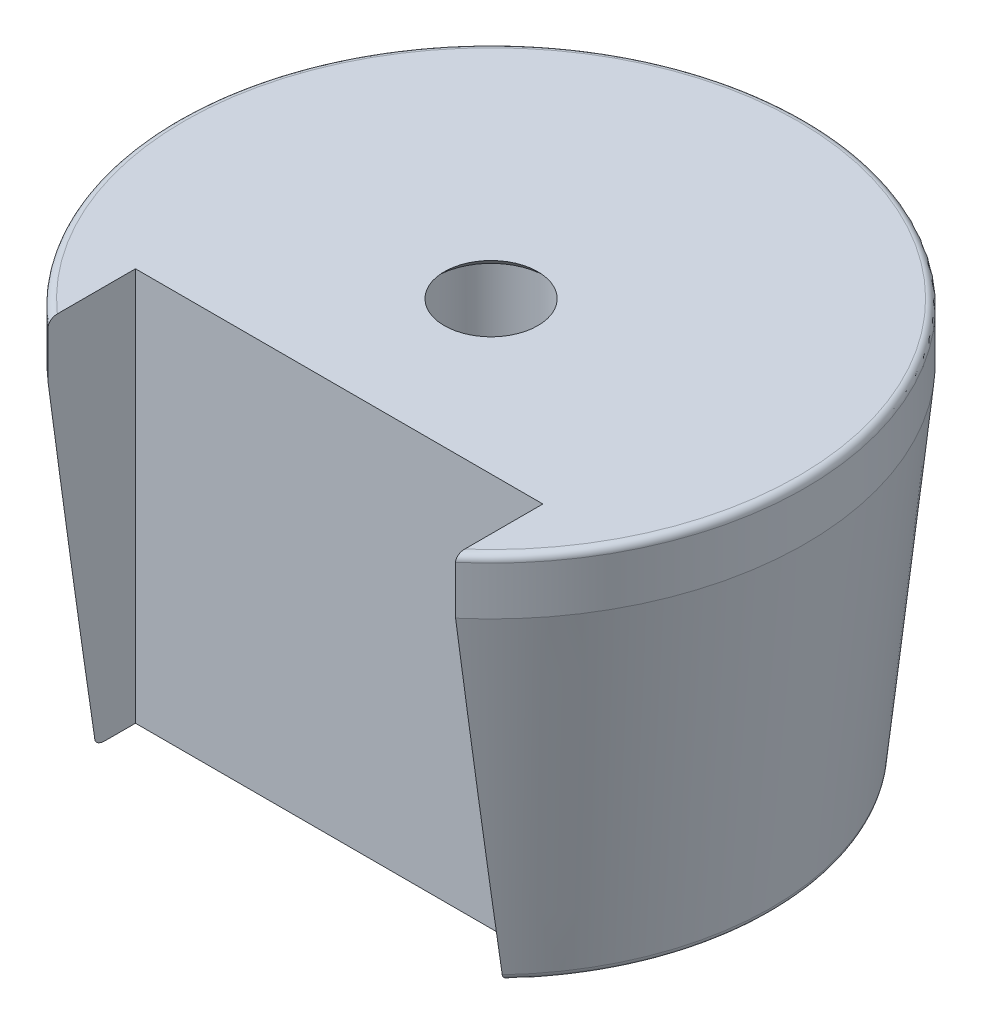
ISO-10303-21;
HEADER;
FILE_DESCRIPTION(('STEP AP214'),'2;1');
FILE_NAME('part.step','',(''),(''),'','','');
FILE_SCHEMA(('AUTOMOTIVE_DESIGN { 1 0 10303 214 1 1 1 1 }'));
ENDSEC;
DATA;
#1=APPLICATION_CONTEXT('core data for automotive mechanical design processes');
#2=APPLICATION_PROTOCOL_DEFINITION('international standard','automotive_design',2000,#1);
#3=PRODUCT_CONTEXT('',#1,'mechanical');
#4=PRODUCT('Part','Part','',(#3));
#5=PRODUCT_RELATED_PRODUCT_CATEGORY('part','',(#4));
#6=PRODUCT_DEFINITION_FORMATION('','',#4);
#7=PRODUCT_DEFINITION_CONTEXT('part definition',#1,'design');
#8=PRODUCT_DEFINITION('design','',#6,#7);
#9=PRODUCT_DEFINITION_SHAPE('','',#8);
#10=(LENGTH_UNIT() NAMED_UNIT(*) SI_UNIT(.MILLI.,.METRE.));
#11=(NAMED_UNIT(*) PLANE_ANGLE_UNIT() SI_UNIT($,.RADIAN.));
#12=(NAMED_UNIT(*) SI_UNIT($,.STERADIAN.) SOLID_ANGLE_UNIT());
#13=UNCERTAINTY_MEASURE_WITH_UNIT(LENGTH_MEASURE(1.E-05),#10,'distance_accuracy_value','');
#14=(GEOMETRIC_REPRESENTATION_CONTEXT(3) GLOBAL_UNCERTAINTY_ASSIGNED_CONTEXT((#13)) GLOBAL_UNIT_ASSIGNED_CONTEXT((#10,
#11,#12)) REPRESENTATION_CONTEXT('',''));
#15=CARTESIAN_POINT('',(0.,0.,0.));
#16=DIRECTION('',(0.,0.,1.));
#17=DIRECTION('',(1.,0.,0.));
#18=AXIS2_PLACEMENT_3D('',#15,#16,#17);
#19=CARTESIAN_POINT('',(0.,0.,-69.));
#20=DIRECTION('',(0.,1.,0.));
#21=DIRECTION('',(0.,0.,1.));
#22=AXIS2_PLACEMENT_3D('',#19,#20,#21);
#23=PLANE('',#22);
#24=CARTESIAN_POINT('',(0.,0.,-69.));
#25=DIRECTION('',(0.,-1.,0.));
#26=DIRECTION('',(0.,0.,-1.));
#27=AXIS2_PLACEMENT_3D('',#24,#25,#26);
#28=CIRCLE('',#27,8.);
#29=CARTESIAN_POINT('',(0.,0.,-77.));
#30=VERTEX_POINT('',#29);
#31=EDGE_CURVE('E19',#30,#30,#28,.F.);
#32=ORIENTED_EDGE('',*,*,#31,.T.);
#33=EDGE_LOOP('',(#32));
#34=FACE_BOUND('',#33,.T.);
#35=ADVANCED_FACE('F16',(#34),#23,.T.);
#36=CARTESIAN_POINT('',(0.,132.,-69.));
#37=DIRECTION('',(0.,-1.,0.));
#38=DIRECTION('',(0.,0.,-1.));
#39=AXIS2_PLACEMENT_3D('',#36,#37,#38);
#40=CYLINDRICAL_SURFACE('',#39,8.);
#41=ORIENTED_EDGE('',*,*,#31,.F.);
#42=EDGE_LOOP('',(#41));
#43=FACE_BOUND('',#42,.T.);
#44=CARTESIAN_POINT('',(0.,25.773,-69.));
#45=DIRECTION('',(0.,-1.,0.));
#46=DIRECTION('',(0.,0.,-1.));
#47=AXIS2_PLACEMENT_3D('',#44,#45,#46);
#48=CIRCLE('',#47,8.);
#49=CARTESIAN_POINT('',(0.,25.773,-77.));
#50=VERTEX_POINT('',#49);
#51=EDGE_CURVE('E135',#50,#50,#48,.F.);
#52=ORIENTED_EDGE('',*,*,#51,.T.);
#53=EDGE_LOOP('',(#52));
#54=FACE_BOUND('',#53,.T.);
#55=ADVANCED_FACE('F171',(#43,#54),#40,.F.);
#56=CARTESIAN_POINT('',(0.,25.773,-69.));
#57=DIRECTION('',(0.,-1.,0.));
#58=DIRECTION('',(1.,0.,0.));
#59=AXIS2_PLACEMENT_3D('',#56,#57,#58);
#60=CONICAL_SURFACE('',#59,8.,0.785398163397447);
#61=ORIENTED_EDGE('',*,*,#51,.F.);
#62=EDGE_LOOP('',(#61));
#63=FACE_BOUND('',#62,.T.);
#64=CARTESIAN_POINT('',(0.,27.,-69.));
#65=DIRECTION('',(0.,-1.,0.));
#66=DIRECTION('',(1.,0.,0.));
#67=AXIS2_PLACEMENT_3D('',#64,#65,#66);
#68=CIRCLE('',#67,6.773);
#69=CARTESIAN_POINT('',(6.773,27.,-69.));
#70=VERTEX_POINT('',#69);
#71=EDGE_CURVE('E125',#70,#70,#68,.F.);
#72=ORIENTED_EDGE('',*,*,#71,.T.);
#73=EDGE_LOOP('',(#72));
#74=FACE_BOUND('',#73,.T.);
#75=ADVANCED_FACE('F169',(#63,#74),#60,.F.);
#76=CARTESIAN_POINT('',(0.,-30.,-69.));
#77=DIRECTION('',(0.,1.,0.));
#78=DIRECTION('',(0.,0.,1.));
#79=AXIS2_PLACEMENT_3D('',#76,#77,#78);
#80=PLANE('',#79);
#81=DIRECTION('',(1.,0.,0.));
#82=VECTOR('',#81,1.);
#83=CARTESIAN_POINT('',(-29.5,-30.,-47.));
#84=LINE('',#83,#82);
#85=CARTESIAN_POINT('',(-29.5,-30.,-47.));
#86=VERTEX_POINT('',#85);
#87=CARTESIAN_POINT('',(29.5,-30.,-47.));
#88=VERTEX_POINT('',#87);
#89=EDGE_CURVE('E128',#86,#88,#84,.T.);
#90=ORIENTED_EDGE('',*,*,#89,.F.);
#91=DIRECTION('',(0.,0.,-1.));
#92=VECTOR('',#91,1.);
#93=CARTESIAN_POINT('',(-29.5,-30.,-31.7709790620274));
#94=LINE('',#93,#92);
#95=CARTESIAN_POINT('',(-29.5,-30.,-42.5867385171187));
#96=VERTEX_POINT('',#95);
#97=EDGE_CURVE('E221',#96,#86,#94,.T.);
#98=ORIENTED_EDGE('',*,*,#97,.F.);
#99=CARTESIAN_POINT('',(0.,-30.,-69.));
#100=DIRECTION('',(0.,1.,0.));
#101=DIRECTION('',(0.74500879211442,0.,0.667054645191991));
#102=AXIS2_PLACEMENT_3D('',#99,#100,#101);
#103=CIRCLE('',#102,39.5968481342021);
#104=CARTESIAN_POINT('',(29.5,-30.,-42.5867385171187));
#105=VERTEX_POINT('',#104);
#106=EDGE_CURVE('E66',#105,#96,#103,.T.);
#107=ORIENTED_EDGE('',*,*,#106,.F.);
#108=DIRECTION('',(0.,0.,1.));
#109=VECTOR('',#108,1.);
#110=CARTESIAN_POINT('',(29.5,-30.,-47.));
#111=LINE('',#110,#109);
#112=EDGE_CURVE('E62',#88,#105,#111,.T.);
#113=ORIENTED_EDGE('',*,*,#112,.F.);
#114=EDGE_LOOP('',(#90,#98,#107,#113));
#115=FACE_BOUND('',#114,.T.);
#116=ADVANCED_FACE('F158',(#115),#80,.F.);
#117=CARTESIAN_POINT('',(-29.5,-105.,-47.));
#118=DIRECTION('',(0.,0.,1.));
#119=DIRECTION('',(1.,0.,0.));
#120=AXIS2_PLACEMENT_3D('',#117,#118,#119);
#121=PLANE('',#120);
#122=DIRECTION('',(1.,0.,0.));
#123=VECTOR('',#122,1.);
#124=CARTESIAN_POINT('',(0.,27.,-47.));
#125=LINE('',#124,#123);
#126=CARTESIAN_POINT('',(29.5,27.,-47.));
#127=VERTEX_POINT('',#126);
#128=CARTESIAN_POINT('',(-29.5,27.,-47.));
#129=VERTEX_POINT('',#128);
#130=EDGE_CURVE('E127',#127,#129,#125,.F.);
#131=ORIENTED_EDGE('',*,*,#130,.T.);
#132=DIRECTION('',(0.,1.,0.));
#133=VECTOR('',#132,1.);
#134=CARTESIAN_POINT('',(-29.5,-105.,-47.));
#135=LINE('',#134,#133);
#136=EDGE_CURVE('E216',#86,#129,#135,.T.);
#137=ORIENTED_EDGE('',*,*,#136,.F.);
#138=ORIENTED_EDGE('',*,*,#89,.T.);
#139=DIRECTION('',(0.,1.,0.));
#140=VECTOR('',#139,1.);
#141=CARTESIAN_POINT('',(29.5,-105.,-47.));
#142=LINE('',#141,#140);
#143=EDGE_CURVE('E67',#127,#88,#142,.F.);
#144=ORIENTED_EDGE('',*,*,#143,.F.);
#145=EDGE_LOOP('',(#131,#137,#138,#144));
#146=FACE_BOUND('',#145,.T.);
#147=ADVANCED_FACE('F168',(#146),#121,.T.);
#148=CARTESIAN_POINT('',(0.,27.,-24.5));
#149=DIRECTION('',(0.,-1.,0.));
#150=DIRECTION('',(0.,0.,-1.));
#151=AXIS2_PLACEMENT_3D('',#148,#149,#150);
#152=PLANE('',#151);
#153=CARTESIAN_POINT('',(0.,27.,-69.));
#154=DIRECTION('',(0.,-1.,0.));
#155=DIRECTION('',(-0.662921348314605,0.,0.748689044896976));
#156=AXIS2_PLACEMENT_3D('',#153,#154,#155);
#157=CIRCLE('',#156,44.5);
#158=CARTESIAN_POINT('',(-29.5,27.,-35.6833375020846));
#159=VERTEX_POINT('',#158);
#160=CARTESIAN_POINT('',(29.5,27.,-35.6833375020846));
#161=VERTEX_POINT('',#160);
#162=EDGE_CURVE('E132',#159,#161,#157,.T.);
#163=ORIENTED_EDGE('',*,*,#162,.F.);
#164=DIRECTION('',(0.,0.,-1.));
#165=VECTOR('',#164,1.);
#166=CARTESIAN_POINT('',(-29.5,27.,-31.7709790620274));
#167=LINE('',#166,#165);
#168=EDGE_CURVE('E206',#129,#159,#167,.F.);
#169=ORIENTED_EDGE('',*,*,#168,.F.);
#170=ORIENTED_EDGE('',*,*,#130,.F.);
#171=DIRECTION('',(0.,0.,1.));
#172=VECTOR('',#171,1.);
#173=CARTESIAN_POINT('',(29.5,27.,-47.));
#174=LINE('',#173,#172);
#175=EDGE_CURVE('E231',#161,#127,#174,.F.);
#176=ORIENTED_EDGE('',*,*,#175,.F.);
#177=EDGE_LOOP('',(#163,#169,#170,#176));
#178=FACE_BOUND('',#177,.T.);
#179=ORIENTED_EDGE('',*,*,#71,.F.);
#180=EDGE_LOOP('',(#179));
#181=FACE_BOUND('',#180,.T.);
#182=ADVANCED_FACE('F248',(#178,#181),#152,.F.);
#183=CARTESIAN_POINT('',(0.,26.,-69.));
#184=DIRECTION('',(0.,1.,0.));
#185=DIRECTION('',(0.,0.,1.));
#186=AXIS2_PLACEMENT_3D('',#183,#184,#185);
#187=TOROIDAL_SURFACE('',#186,44.5,1.);
#188=CARTESIAN_POINT('',(0.,26.,-69.));
#189=DIRECTION('',(0.,-1.,0.));
#190=DIRECTION('',(0.,0.,-1.));
#191=AXIS2_PLACEMENT_3D('',#188,#189,#190);
#192=CIRCLE('',#191,45.5);
#193=CARTESIAN_POINT('',(-29.5,26.,-34.3589838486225));
#194=VERTEX_POINT('',#193);
#195=CARTESIAN_POINT('',(29.5,26.,-34.3589838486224));
#196=VERTEX_POINT('',#195);
#197=EDGE_CURVE('E78',#194,#196,#192,.T.);
#198=ORIENTED_EDGE('',*,*,#197,.F.);
#199=CARTESIAN_POINT('',(-29.5,27.,-35.6833375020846));
#200=CARTESIAN_POINT('',(-29.5,26.999994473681,-35.6412291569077));
#201=CARTESIAN_POINT('',(-29.5,26.9985088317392,-35.5991367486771));
#202=CARTESIAN_POINT('',(-29.5,26.9925292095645,-35.5151422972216));
#203=CARTESIAN_POINT('',(-29.5,26.98803348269,-35.4732403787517));
#204=CARTESIAN_POINT('',(-29.5,26.9698856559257,-35.3476069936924));
#205=CARTESIAN_POINT('',(-29.5,26.9515715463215,-35.2644828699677));
#206=CARTESIAN_POINT('',(-29.5,26.9044360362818,-35.1101125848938));
#207=CARTESIAN_POINT('',(-29.5,26.8768147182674,-35.038498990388));
#208=CARTESIAN_POINT('',(-29.5,26.8105216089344,-34.9006690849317));
#209=CARTESIAN_POINT('',(-29.5,26.771879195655,-34.8344390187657));
#210=CARTESIAN_POINT('',(-29.5,26.6934195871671,-34.7246100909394));
#211=CARTESIAN_POINT('',(-29.5,26.655961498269,-34.6793283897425));
#212=CARTESIAN_POINT('',(-29.5,26.5742463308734,-34.5953241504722));
#213=CARTESIAN_POINT('',(-29.5,26.5299956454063,-34.5565955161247));
#214=CARTESIAN_POINT('',(-29.5,26.4436447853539,-34.4939762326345));
#215=CARTESIAN_POINT('',(-29.5,26.4025733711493,-34.4686707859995));
#216=CARTESIAN_POINT('',(-29.5,26.3168373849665,-34.4252229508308));
#217=CARTESIAN_POINT('',(-29.5,26.2721798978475,-34.4070668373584));
#218=CARTESIAN_POINT('',(-29.5,26.189719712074,-34.3819020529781));
#219=CARTESIAN_POINT('',(-29.5,26.1523780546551,-34.3733745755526));
#220=CARTESIAN_POINT('',(-29.5,26.076708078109,-34.3618837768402));
#221=CARTESIAN_POINT('',(-29.5,26.038376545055,-34.3589417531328));
#222=CARTESIAN_POINT('',(-29.5,26.,-34.3589838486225));
#223=B_SPLINE_CURVE_WITH_KNOTS('',3,(#199,#200,#201,#202,#203,#204,#205,#206,#207,#208,#209,
#210,#211,#212,#213,#214,#215,#216,#217,#218,#219,#220,#221,#222),.UNSPECIFIED.,.F.,.F.,(4,2,2,
2,2,2,2,2,2,2,2,4),(0.,0.126265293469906,0.252603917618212,0.50687140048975,0.736320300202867,
0.965163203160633,1.14083474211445,1.31634194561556,1.46048640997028,1.60435278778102,
1.71885837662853,1.83379971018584),.UNSPECIFIED.);
#224=EDGE_CURVE('E205',#159,#194,#223,.T.);
#225=ORIENTED_EDGE('',*,*,#224,.F.);
#226=ORIENTED_EDGE('',*,*,#162,.T.);
#227=CARTESIAN_POINT('',(29.5,26.,-34.3589838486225));
#228=CARTESIAN_POINT('',(29.5,26.0233980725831,-34.3589805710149));
#229=CARTESIAN_POINT('',(29.5,26.0467826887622,-34.3600633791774));
#230=CARTESIAN_POINT('',(29.5,26.0933416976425,-34.3643598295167));
#231=CARTESIAN_POINT('',(29.5,26.1165162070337,-34.3675722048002));
#232=CARTESIAN_POINT('',(29.5,26.1851310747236,-34.3802769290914));
#233=CARTESIAN_POINT('',(29.5,26.2300348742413,-34.3928383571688));
#234=CARTESIAN_POINT('',(29.5,26.3169361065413,-34.4253090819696));
#235=CARTESIAN_POINT('',(29.5,26.3589391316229,-34.4452037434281));
#236=CARTESIAN_POINT('',(29.5,26.4394056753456,-34.491271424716));
#237=CARTESIAN_POINT('',(29.5,26.4778626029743,-34.5174558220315));
#238=CARTESIAN_POINT('',(29.5,26.5627951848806,-34.5845074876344));
#239=CARTESIAN_POINT('',(29.5,26.6076998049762,-34.6273641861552));
#240=CARTESIAN_POINT('',(29.5,26.6899328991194,-34.7197947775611));
#241=CARTESIAN_POINT('',(29.5,26.7272499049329,-34.7693786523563));
#242=CARTESIAN_POINT('',(29.5,26.8045161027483,-34.8890402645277));
#243=CARTESIAN_POINT('',(29.5,26.8418689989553,-34.9607907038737));
#244=CARTESIAN_POINT('',(29.5,26.9045124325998,-35.1094149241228));
#245=CARTESIAN_POINT('',(29.5,26.929780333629,-35.1862980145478));
#246=CARTESIAN_POINT('',(29.5,26.9664015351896,-35.3331826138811));
#247=CARTESIAN_POINT('',(29.5,26.9790888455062,-35.4028598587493));
#248=CARTESIAN_POINT('',(29.5,26.9958485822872,-35.5428203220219));
#249=CARTESIAN_POINT('',(29.5,26.9999729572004,-35.613097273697));
#250=CARTESIAN_POINT('',(29.5,27.,-35.6833375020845));
#251=B_SPLINE_CURVE_WITH_KNOTS('',3,(#227,#228,#229,#230,#231,#232,#233,#234,#235,#236,#237,
#238,#239,#240,#241,#242,#243,#244,#245,#246,#247,#248,#249,#250),.UNSPECIFIED.,.F.,.F.,(4,2,2,
2,2,2,2,2,2,2,2,4),(0.,0.0701434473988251,0.140245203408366,0.2793489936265,0.418176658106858,
0.557257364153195,0.742468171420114,0.927956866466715,1.16934892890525,1.41119138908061,
1.62313638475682,1.83379177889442),.UNSPECIFIED.);
#252=EDGE_CURVE('E124',#196,#161,#251,.T.);
#253=ORIENTED_EDGE('',*,*,#252,.F.);
#254=EDGE_LOOP('',(#198,#225,#226,#253));
#255=FACE_BOUND('',#254,.T.);
#256=ADVANCED_FACE('F103',(#255),#187,.T.);
#257=CARTESIAN_POINT('',(29.5,-105.,-47.));
#258=DIRECTION('',(-1.,0.,0.));
#259=DIRECTION('',(0.,0.,1.));
#260=AXIS2_PLACEMENT_3D('',#257,#258,#259);
#261=PLANE('',#260);
#262=ORIENTED_EDGE('',*,*,#175,.T.);
#263=ORIENTED_EDGE('',*,*,#143,.T.);
#264=ORIENTED_EDGE('',*,*,#112,.T.);
#265=CARTESIAN_POINT('',(29.5,-29.1015136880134,-41.1174845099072));
#266=CARTESIAN_POINT('',(29.5,-29.1249335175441,-41.1209585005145));
#267=CARTESIAN_POINT('',(29.5,-29.1481547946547,-41.1256306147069));
#268=CARTESIAN_POINT('',(29.5,-29.1939971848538,-41.1372246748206));
#269=CARTESIAN_POINT('',(29.5,-29.2166190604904,-41.1441435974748));
#270=CARTESIAN_POINT('',(29.5,-29.2828862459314,-41.1678952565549));
#271=CARTESIAN_POINT('',(29.5,-29.3254545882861,-41.1878057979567));
#272=CARTESIAN_POINT('',(29.5,-29.406425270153,-41.2342428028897));
#273=CARTESIAN_POINT('',(29.5,-29.4448475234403,-41.2607354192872));
#274=CARTESIAN_POINT('',(29.5,-29.5175563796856,-41.3190229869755));
#275=CARTESIAN_POINT('',(29.5,-29.5518305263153,-41.3508332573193));
#276=CARTESIAN_POINT('',(29.5,-29.6336654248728,-41.4369717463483));
#277=CARTESIAN_POINT('',(29.5,-29.6782647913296,-41.4941125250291));
#278=CARTESIAN_POINT('',(29.5,-29.757889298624,-41.6146976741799));
#279=CARTESIAN_POINT('',(29.5,-29.7928930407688,-41.6781557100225));
#280=CARTESIAN_POINT('',(29.5,-29.8672548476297,-41.8372125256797));
#281=CARTESIAN_POINT('',(29.5,-29.9020550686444,-41.9349349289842));
#282=CARTESIAN_POINT('',(29.5,-29.9557467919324,-42.1345470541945));
#283=CARTESIAN_POINT('',(29.5,-29.9746317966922,-42.236438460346));
#284=CARTESIAN_POINT('',(29.5,-29.9908230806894,-42.3802486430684));
#285=CARTESIAN_POINT('',(29.5,-29.9942794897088,-42.4215581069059));
#286=CARTESIAN_POINT('',(29.5,-29.9988622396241,-42.5041541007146));
#287=CARTESIAN_POINT('',(29.5,-29.999997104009,-42.545440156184));
#288=CARTESIAN_POINT('',(29.5,-30.,-42.5867385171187));
#289=B_SPLINE_CURVE_WITH_KNOTS('',3,(#265,#266,#267,#268,#269,#270,#271,#272,#273,#274,#275,
#276,#277,#278,#279,#280,#281,#282,#283,#284,#285,#286,#287,#288),.UNSPECIFIED.,.F.,.F.,(4,2,2,
2,2,2,2,2,2,2,2,4),(0.,0.0709617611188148,0.141828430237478,0.282003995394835,0.421473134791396,
0.561351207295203,0.777592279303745,0.994311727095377,1.30386633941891,1.61354726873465,
1.73785818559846,1.86171187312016),.UNSPECIFIED.);
#290=CARTESIAN_POINT('',(29.5,-29.1015136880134,-41.1174845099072));
#291=VERTEX_POINT('',#290);
#292=EDGE_CURVE('E51',#291,#105,#289,.T.);
#293=ORIENTED_EDGE('',*,*,#292,.F.);
#294=CARTESIAN_POINT('',(29.5,19.,-34.3589838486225));
#295=CARTESIAN_POINT('',(29.5,16.9939948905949,-34.6278467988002));
#296=CARTESIAN_POINT('',(29.5,14.9881623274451,-34.897996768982));
#297=CARTESIAN_POINT('',(29.5,10.9768722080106,-35.44107193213));
#298=CARTESIAN_POINT('',(29.5,8.97141465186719,-35.7139971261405));
#299=CARTESIAN_POINT('',(29.5,2.95570305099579,-36.5372299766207));
#300=CARTESIAN_POINT('',(29.5,-1.05394136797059,-37.0920017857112));
#301=CARTESIAN_POINT('',(29.5,-9.07130109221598,-38.2154081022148));
#302=CARTESIAN_POINT('',(29.5,-13.0790163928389,-38.7840426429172));
#303=CARTESIAN_POINT('',(29.5,-19.088845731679,-39.6492763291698));
#304=CARTESIAN_POINT('',(29.5,-21.0918441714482,-39.9397364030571));
#305=CARTESIAN_POINT('',(29.5,-25.0971867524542,-40.5251451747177));
#306=CARTESIAN_POINT('',(29.5,-27.0995308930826,-40.8200938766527));
#307=CARTESIAN_POINT('',(29.5,-29.1015136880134,-41.1174845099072));
#308=B_SPLINE_CURVE_WITH_KNOTS('',3,(#294,#295,#296,#297,#298,#299,#300,#301,#302,#303,#304,
#305,#306,#307),.UNSPECIFIED.,.F.,.F.,(4,2,2,2,2,2,4),(0.,6.07182723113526,12.1436567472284,
24.2871600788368,36.4306925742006,42.5025352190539,48.5743834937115),.UNSPECIFIED.);
#309=CARTESIAN_POINT('',(29.5,19.,-34.3589838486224));
#310=VERTEX_POINT('',#309);
#311=EDGE_CURVE('E57',#310,#291,#308,.T.);
#312=ORIENTED_EDGE('',*,*,#311,.F.);
#313=DIRECTION('',(0.,-1.,0.));
#314=VECTOR('',#313,1.);
#315=CARTESIAN_POINT('',(29.5,132.,-34.3589838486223));
#316=LINE('',#315,#314);
#317=EDGE_CURVE('E215',#196,#310,#316,.T.);
#318=ORIENTED_EDGE('',*,*,#317,.F.);
#319=ORIENTED_EDGE('',*,*,#252,.T.);
#320=EDGE_LOOP('',(#262,#263,#264,#293,#312,#318,#319));
#321=FACE_BOUND('',#320,.T.);
#322=ADVANCED_FACE('F54',(#321),#261,.T.);
#323=CARTESIAN_POINT('',(0.,-29.,-69.));
#324=DIRECTION('',(0.,1.,0.));
#325=DIRECTION('',(0.,0.,1.));
#326=AXIS2_PLACEMENT_3D('',#323,#324,#325);
#327=TOROIDAL_SURFACE('',#326,39.5968481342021,1.);
#328=ORIENTED_EDGE('',*,*,#106,.T.);
#329=CARTESIAN_POINT('',(-29.5,-29.1015136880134,-41.1174845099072));
#330=CARTESIAN_POINT('',(-29.5,-29.1249335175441,-41.1209585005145));
#331=CARTESIAN_POINT('',(-29.5,-29.1481547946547,-41.1256306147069));
#332=CARTESIAN_POINT('',(-29.5,-29.1939971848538,-41.1372246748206));
#333=CARTESIAN_POINT('',(-29.5,-29.2166190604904,-41.1441435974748));
#334=CARTESIAN_POINT('',(-29.5,-29.2828862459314,-41.1678952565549));
#335=CARTESIAN_POINT('',(-29.5,-29.3254545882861,-41.1878057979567));
#336=CARTESIAN_POINT('',(-29.5,-29.406425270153,-41.2342428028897));
#337=CARTESIAN_POINT('',(-29.5,-29.4448475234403,-41.2607354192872));
#338=CARTESIAN_POINT('',(-29.5,-29.5175563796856,-41.3190229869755));
#339=CARTESIAN_POINT('',(-29.5,-29.5518305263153,-41.3508332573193));
#340=CARTESIAN_POINT('',(-29.5,-29.6336654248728,-41.4369717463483));
#341=CARTESIAN_POINT('',(-29.5,-29.6782647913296,-41.4941125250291));
#342=CARTESIAN_POINT('',(-29.5,-29.757889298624,-41.6146976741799));
#343=CARTESIAN_POINT('',(-29.5,-29.7928930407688,-41.6781557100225));
#344=CARTESIAN_POINT('',(-29.5,-29.8672548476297,-41.8372125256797));
#345=CARTESIAN_POINT('',(-29.5,-29.9020550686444,-41.9349349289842));
#346=CARTESIAN_POINT('',(-29.5,-29.9557467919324,-42.1345470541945));
#347=CARTESIAN_POINT('',(-29.5,-29.9746317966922,-42.236438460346));
#348=CARTESIAN_POINT('',(-29.5,-29.9908230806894,-42.3802486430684));
#349=CARTESIAN_POINT('',(-29.5,-29.9942794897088,-42.4215581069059));
#350=CARTESIAN_POINT('',(-29.5,-29.9988622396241,-42.5041541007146));
#351=CARTESIAN_POINT('',(-29.5,-29.999997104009,-42.545440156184));
#352=CARTESIAN_POINT('',(-29.5,-30.,-42.5867385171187));
#353=B_SPLINE_CURVE_WITH_KNOTS('',3,(#329,#330,#331,#332,#333,#334,#335,#336,#337,#338,#339,
#340,#341,#342,#343,#344,#345,#346,#347,#348,#349,#350,#351,#352),.UNSPECIFIED.,.F.,.F.,(4,2,2,
2,2,2,2,2,2,2,2,4),(0.,0.0709617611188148,0.141828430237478,0.282003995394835,0.421473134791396,
0.561351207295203,0.777592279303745,0.994311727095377,1.30386633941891,1.61354726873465,
1.73785818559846,1.86171187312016),.UNSPECIFIED.);
#354=CARTESIAN_POINT('',(-29.5,-29.1015136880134,-41.1174845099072));
#355=VERTEX_POINT('',#354);
#356=EDGE_CURVE('E73',#355,#96,#353,.T.);
#357=ORIENTED_EDGE('',*,*,#356,.F.);
#358=CARTESIAN_POINT('',(0.,-29.1015136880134,-69.));
#359=DIRECTION('',(0.,1.,0.));
#360=DIRECTION('',(0.,0.,1.));
#361=AXIS2_PLACEMENT_3D('',#358,#359,#360);
#362=CIRCLE('',#361,40.5916822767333);
#363=EDGE_CURVE('E70',#291,#355,#362,.T.);
#364=ORIENTED_EDGE('',*,*,#363,.F.);
#365=ORIENTED_EDGE('',*,*,#292,.T.);
#366=EDGE_LOOP('',(#328,#357,#364,#365));
#367=FACE_BOUND('',#366,.T.);
#368=ADVANCED_FACE('F71',(#367),#327,.T.);
#369=CARTESIAN_POINT('',(-29.5,-105.,-31.7709790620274));
#370=DIRECTION('',(1.,0.,0.));
#371=DIRECTION('',(0.,0.,-1.));
#372=AXIS2_PLACEMENT_3D('',#369,#370,#371);
#373=PLANE('',#372);
#374=CARTESIAN_POINT('',(-29.5,-29.1015136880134,-41.1174845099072));
#375=CARTESIAN_POINT('',(-29.5,-27.0995308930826,-40.8200938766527));
#376=CARTESIAN_POINT('',(-29.5,-25.0971867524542,-40.5251451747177));
#377=CARTESIAN_POINT('',(-29.5,-21.0918441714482,-39.9397364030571));
#378=CARTESIAN_POINT('',(-29.5,-19.088845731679,-39.6492763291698));
#379=CARTESIAN_POINT('',(-29.5,-13.0790163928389,-38.7840426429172));
#380=CARTESIAN_POINT('',(-29.5,-9.07130109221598,-38.2154081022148));
#381=CARTESIAN_POINT('',(-29.5,-1.05394136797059,-37.0920017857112));
#382=CARTESIAN_POINT('',(-29.5,2.95570305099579,-36.5372299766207));
#383=CARTESIAN_POINT('',(-29.5,8.97141465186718,-35.7139971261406));
#384=CARTESIAN_POINT('',(-29.5,10.9768722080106,-35.44107193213));
#385=CARTESIAN_POINT('',(-29.5,14.9881623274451,-34.897996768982));
#386=CARTESIAN_POINT('',(-29.5,16.9939948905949,-34.6278467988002));
#387=CARTESIAN_POINT('',(-29.5,19.,-34.3589838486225));
#388=B_SPLINE_CURVE_WITH_KNOTS('',3,(#374,#375,#376,#377,#378,#379,#380,#381,#382,#383,#384,
#385,#386,#387),.UNSPECIFIED.,.F.,.F.,(4,2,2,2,2,2,4),(0.,6.07184827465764,12.1436909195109,
24.2872234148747,36.4307267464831,42.5025562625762,48.5743834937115),.UNSPECIFIED.);
#389=CARTESIAN_POINT('',(-29.5,19.,-34.3589838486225));
#390=VERTEX_POINT('',#389);
#391=EDGE_CURVE('E25',#355,#390,#388,.T.);
#392=ORIENTED_EDGE('',*,*,#391,.F.);
#393=ORIENTED_EDGE('',*,*,#356,.T.);
#394=ORIENTED_EDGE('',*,*,#97,.T.);
#395=ORIENTED_EDGE('',*,*,#136,.T.);
#396=ORIENTED_EDGE('',*,*,#168,.T.);
#397=ORIENTED_EDGE('',*,*,#224,.T.);
#398=DIRECTION('',(0.,-1.,0.));
#399=VECTOR('',#398,1.);
#400=CARTESIAN_POINT('',(-29.5,132.,-34.3589838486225));
#401=LINE('',#400,#399);
#402=EDGE_CURVE('E34',#390,#194,#401,.F.);
#403=ORIENTED_EDGE('',*,*,#402,.F.);
#404=EDGE_LOOP('',(#392,#393,#394,#395,#396,#397,#403));
#405=FACE_BOUND('',#404,.T.);
#406=ADVANCED_FACE('F189',(#405),#373,.T.);
#407=CARTESIAN_POINT('',(0.,132.,-69.));
#408=DIRECTION('',(0.,-1.,0.));
#409=DIRECTION('',(0.,0.,-1.));
#410=AXIS2_PLACEMENT_3D('',#407,#408,#409);
#411=CYLINDRICAL_SURFACE('',#410,45.5);
#412=ORIENTED_EDGE('',*,*,#402,.T.);
#413=ORIENTED_EDGE('',*,*,#197,.T.);
#414=ORIENTED_EDGE('',*,*,#317,.T.);
#415=CARTESIAN_POINT('',(0.,19.,-69.));
#416=DIRECTION('',(0.,1.,0.));
#417=DIRECTION('',(0.,0.,1.));
#418=AXIS2_PLACEMENT_3D('',#415,#416,#417);
#419=CIRCLE('',#418,45.5);
#420=EDGE_CURVE('E11',#390,#310,#419,.F.);
#421=ORIENTED_EDGE('',*,*,#420,.F.);
#422=EDGE_LOOP('',(#412,#413,#414,#421));
#423=FACE_BOUND('',#422,.T.);
#424=ADVANCED_FACE('F184',(#423),#411,.T.);
#425=CARTESIAN_POINT('',(0.,19.,-69.));
#426=DIRECTION('',(0.,1.,0.));
#427=DIRECTION('',(-1.,0.,0.));
#428=AXIS2_PLACEMENT_3D('',#425,#426,#427);
#429=CONICAL_SURFACE('',#428,45.5,0.101688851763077);
#430=ORIENTED_EDGE('',*,*,#391,.T.);
#431=ORIENTED_EDGE('',*,*,#420,.T.);
#432=ORIENTED_EDGE('',*,*,#311,.T.);
#433=ORIENTED_EDGE('',*,*,#363,.T.);
#434=EDGE_LOOP('',(#430,#431,#432,#433));
#435=FACE_BOUND('',#434,.T.);
#436=ADVANCED_FACE('F77',(#435),#429,.T.);
#437=CLOSED_SHELL('',(#35,#55,#75,#116,#147,#182,#256,#322,#368,#406,#424,#436));
#438=MANIFOLD_SOLID_BREP('B1',#437);
#439=ADVANCED_BREP_SHAPE_REPRESENTATION('',(#18,#438),#14);
#440=SHAPE_DEFINITION_REPRESENTATION(#9,#439);
ENDSEC;
END-ISO-10303-21;
